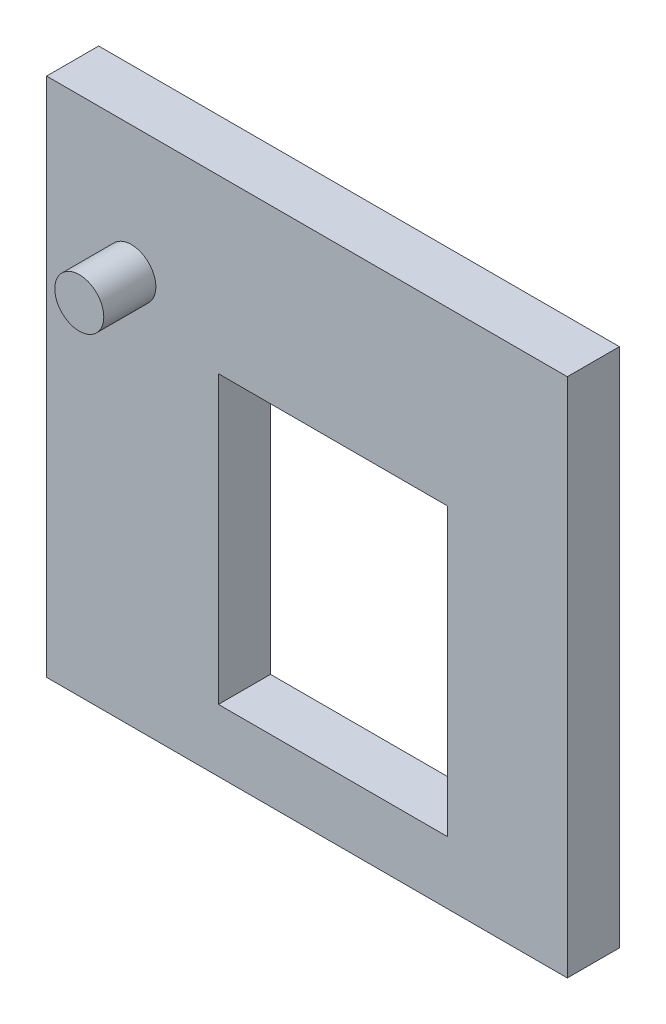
from build123d import *

# Parameters (mm, degrees)
SKIZZE1_W               = 100
SKIZZE1_H               = 100
LINEAR_AUSTRAGEN1_DEPTH = 5
FEHLERSKIZZE_W          = 44
FEHLERSKIZZE_H          = 55
FEHLERFEATURE_DEPTH     = 72.414284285
SKIZZE5_R               = 4.702848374
LINEAR_AUSTRAGEN3_DEPTH = 10


with BuildPart() as part:
    # Skizze1 → Linear austragen1 (new, symmetric)
    with BuildSketch(Plane(origin=(0, 0, 0), x_dir=(-1, 0, 0), z_dir=(0, 0, -1))):
        Rectangle(SKIZZE1_W, SKIZZE1_H)
    extrude(amount=LINEAR_AUSTRAGEN1_DEPTH, both=True)

    # Fehlerskizze → Fehlerfeature (cut, through all)
    with BuildSketch(Plane.XY.offset(5)):
        with Locations((5, -10.5)):
            Rectangle(FEHLERSKIZZE_W, FEHLERSKIZZE_H)
    extrude(amount=-FEHLERFEATURE_DEPTH, mode=Mode.SUBTRACT)

    # Skizze5 → Linear austragen3 (add)
    with BuildSketch(Plane.XY.offset(5)):
        with Locations(Location((-33.721065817, 25.418719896, 0), (0, 0, 180))):
            Circle(SKIZZE5_R)
    extrude(amount=LINEAR_AUSTRAGEN3_DEPTH)


solid = part.part
